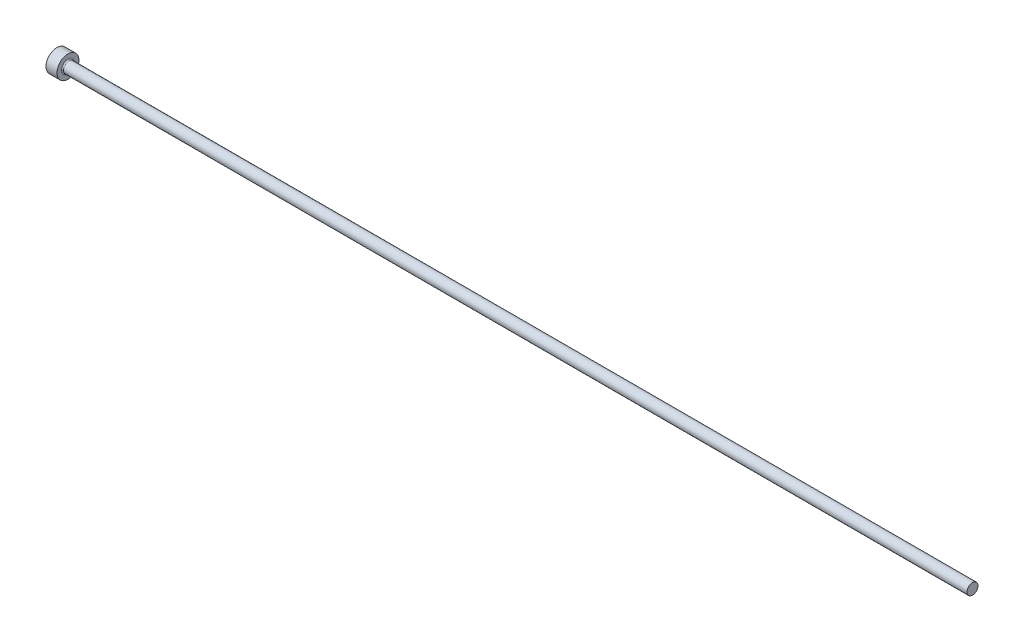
ISO-10303-21;
HEADER;
FILE_DESCRIPTION(('STEP AP214'),'2;1');
FILE_NAME('part.step','',(''),(''),'','','');
FILE_SCHEMA(('AUTOMOTIVE_DESIGN { 1 0 10303 214 1 1 1 1 }'));
ENDSEC;
DATA;
#1=APPLICATION_CONTEXT('core data for automotive mechanical design processes');
#2=APPLICATION_PROTOCOL_DEFINITION('international standard','automotive_design',2000,#1);
#3=PRODUCT_CONTEXT('',#1,'mechanical');
#4=PRODUCT('Part','Part','',(#3));
#5=PRODUCT_RELATED_PRODUCT_CATEGORY('part','',(#4));
#6=PRODUCT_DEFINITION_FORMATION('','',#4);
#7=PRODUCT_DEFINITION_CONTEXT('part definition',#1,'design');
#8=PRODUCT_DEFINITION('design','',#6,#7);
#9=PRODUCT_DEFINITION_SHAPE('','',#8);
#10=(LENGTH_UNIT() NAMED_UNIT(*) SI_UNIT(.MILLI.,.METRE.));
#11=(NAMED_UNIT(*) PLANE_ANGLE_UNIT() SI_UNIT($,.RADIAN.));
#12=(NAMED_UNIT(*) SI_UNIT($,.STERADIAN.) SOLID_ANGLE_UNIT());
#13=UNCERTAINTY_MEASURE_WITH_UNIT(LENGTH_MEASURE(1.E-05),#10,'distance_accuracy_value','');
#14=(GEOMETRIC_REPRESENTATION_CONTEXT(3) GLOBAL_UNCERTAINTY_ASSIGNED_CONTEXT((#13)) GLOBAL_UNIT_ASSIGNED_CONTEXT((#10,
#11,#12)) REPRESENTATION_CONTEXT('',''));
#15=CARTESIAN_POINT('',(0.,0.,0.));
#16=DIRECTION('',(0.,0.,1.));
#17=DIRECTION('',(1.,0.,0.));
#18=AXIS2_PLACEMENT_3D('',#15,#16,#17);
#19=CARTESIAN_POINT('',(0.,0.,0.));
#20=DIRECTION('',(-1.,0.,0.));
#21=DIRECTION('',(0.,-1.,0.));
#22=AXIS2_PLACEMENT_3D('',#19,#20,#21);
#23=PLANE('',#22);
#24=CARTESIAN_POINT('',(0.,0.,0.));
#25=DIRECTION('',(1.,0.,0.));
#26=DIRECTION('',(0.,1.,0.));
#27=AXIS2_PLACEMENT_3D('',#24,#25,#26);
#28=CIRCLE('',#27,3.);
#29=CARTESIAN_POINT('',(0.,3.,0.));
#30=VERTEX_POINT('',#29);
#31=EDGE_CURVE('E25',#30,#30,#28,.T.);
#32=ORIENTED_EDGE('',*,*,#31,.F.);
#33=EDGE_LOOP('',(#32));
#34=FACE_BOUND('',#33,.T.);
#35=ADVANCED_FACE('F14',(#34),#23,.T.);
#36=CARTESIAN_POINT('',(250.,0.,0.));
#37=DIRECTION('',(1.,0.,0.));
#38=DIRECTION('',(0.,1.,0.));
#39=AXIS2_PLACEMENT_3D('',#36,#37,#38);
#40=CYLINDRICAL_SURFACE('',#39,3.);
#41=ORIENTED_EDGE('',*,*,#31,.T.);
#42=EDGE_LOOP('',(#41));
#43=FACE_BOUND('',#42,.T.);
#44=CARTESIAN_POINT('',(3.,0.,0.));
#45=DIRECTION('',(1.,0.,0.));
#46=DIRECTION('',(0.,1.,0.));
#47=AXIS2_PLACEMENT_3D('',#44,#45,#46);
#48=CIRCLE('',#47,3.);
#49=CARTESIAN_POINT('',(3.,3.,0.));
#50=VERTEX_POINT('',#49);
#51=EDGE_CURVE('E29',#50,#50,#48,.T.);
#52=ORIENTED_EDGE('',*,*,#51,.F.);
#53=EDGE_LOOP('',(#52));
#54=FACE_BOUND('',#53,.T.);
#55=ADVANCED_FACE('F51',(#43,#54),#40,.T.);
#56=CARTESIAN_POINT('',(3.,3.,0.));
#57=DIRECTION('',(1.,0.,0.));
#58=DIRECTION('',(0.,1.,0.));
#59=AXIS2_PLACEMENT_3D('',#56,#57,#58);
#60=PLANE('',#59);
#61=CARTESIAN_POINT('',(3.,0.,0.));
#62=DIRECTION('',(1.,0.,0.));
#63=DIRECTION('',(0.,1.,0.));
#64=AXIS2_PLACEMENT_3D('',#61,#62,#63);
#65=CIRCLE('',#64,1.79999999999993);
#66=CARTESIAN_POINT('',(3.,1.79999999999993,0.));
#67=VERTEX_POINT('',#66);
#68=EDGE_CURVE('E9',#67,#67,#65,.F.);
#69=ORIENTED_EDGE('',*,*,#68,.T.);
#70=EDGE_LOOP('',(#69));
#71=FACE_BOUND('',#70,.T.);
#72=ORIENTED_EDGE('',*,*,#51,.T.);
#73=EDGE_LOOP('',(#72));
#74=FACE_BOUND('',#73,.T.);
#75=ADVANCED_FACE('F42',(#71,#74),#60,.T.);
#76=CARTESIAN_POINT('',(250.,0.,0.));
#77=DIRECTION('',(1.,0.,0.));
#78=DIRECTION('',(0.,1.,0.));
#79=AXIS2_PLACEMENT_3D('',#76,#77,#78);
#80=CYLINDRICAL_SURFACE('',#79,1.49999999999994);
#81=CARTESIAN_POINT('',(3.3,0.,0.));
#82=DIRECTION('',(1.,0.,0.));
#83=DIRECTION('',(0.,1.,0.));
#84=AXIS2_PLACEMENT_3D('',#81,#82,#83);
#85=CIRCLE('',#84,1.49999999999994);
#86=CARTESIAN_POINT('',(3.3,1.49999999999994,0.));
#87=VERTEX_POINT('',#86);
#88=EDGE_CURVE('E21',#87,#87,#85,.T.);
#89=ORIENTED_EDGE('',*,*,#88,.T.);
#90=EDGE_LOOP('',(#89));
#91=FACE_BOUND('',#90,.T.);
#92=CARTESIAN_POINT('',(250.,0.,0.));
#93=DIRECTION('',(1.,0.,0.));
#94=DIRECTION('',(0.,1.,0.));
#95=AXIS2_PLACEMENT_3D('',#92,#93,#94);
#96=CIRCLE('',#95,1.49999999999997);
#97=CARTESIAN_POINT('',(250.,1.49999999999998,0.));
#98=VERTEX_POINT('',#97);
#99=EDGE_CURVE('E34',#98,#98,#96,.T.);
#100=ORIENTED_EDGE('',*,*,#99,.F.);
#101=EDGE_LOOP('',(#100));
#102=FACE_BOUND('',#101,.T.);
#103=ADVANCED_FACE('F40',(#91,#102),#80,.T.);
#104=CARTESIAN_POINT('',(250.,1.49999999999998,0.));
#105=DIRECTION('',(1.,0.,0.));
#106=DIRECTION('',(0.,1.,0.));
#107=AXIS2_PLACEMENT_3D('',#104,#105,#106);
#108=PLANE('',#107);
#109=ORIENTED_EDGE('',*,*,#99,.T.);
#110=EDGE_LOOP('',(#109));
#111=FACE_BOUND('',#110,.T.);
#112=ADVANCED_FACE('F38',(#111),#108,.T.);
#113=CARTESIAN_POINT('',(3.3,0.,0.));
#114=DIRECTION('',(1.,0.,0.));
#115=DIRECTION('',(0.,1.,0.));
#116=AXIS2_PLACEMENT_3D('',#113,#114,#115);
#117=TOROIDAL_SURFACE('',#116,1.79999999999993,0.3);
#118=ORIENTED_EDGE('',*,*,#68,.F.);
#119=EDGE_LOOP('',(#118));
#120=FACE_BOUND('',#119,.T.);
#121=ORIENTED_EDGE('',*,*,#88,.F.);
#122=EDGE_LOOP('',(#121));
#123=FACE_BOUND('',#122,.T.);
#124=ADVANCED_FACE('F16',(#120,#123),#117,.F.);
#125=CLOSED_SHELL('',(#35,#55,#75,#103,#112,#124));
#126=MANIFOLD_SOLID_BREP('B1',#125);
#127=ADVANCED_BREP_SHAPE_REPRESENTATION('',(#18,#126),#14);
#128=SHAPE_DEFINITION_REPRESENTATION(#9,#127);
ENDSEC;
END-ISO-10303-21;
